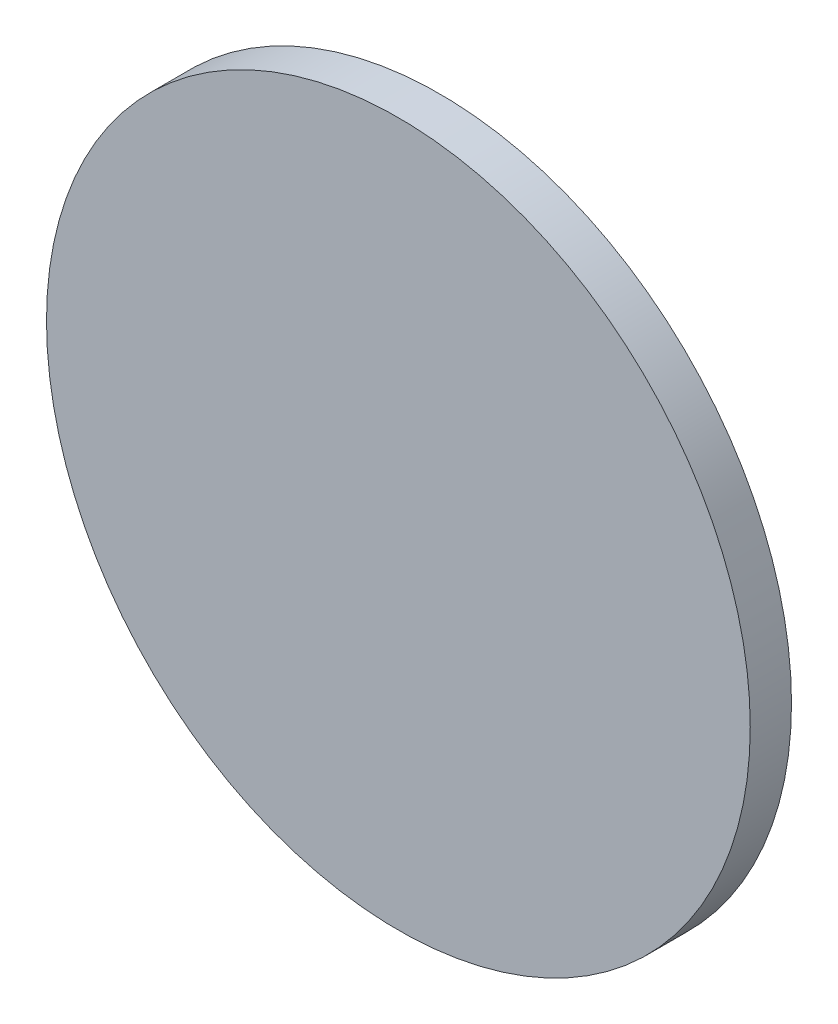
from build123d import *

# Parameters (mm, degrees)
SKETCH1_R          = 30.988
BASE_EXTRUDE_DEPTH = 3.6322


with BuildPart() as part:
    # Sketch1 → Base-Extrude (new body)
    with BuildSketch(Plane.XY):
        Circle(SKETCH1_R)
    extrude(amount=BASE_EXTRUDE_DEPTH)


solid = part.part
